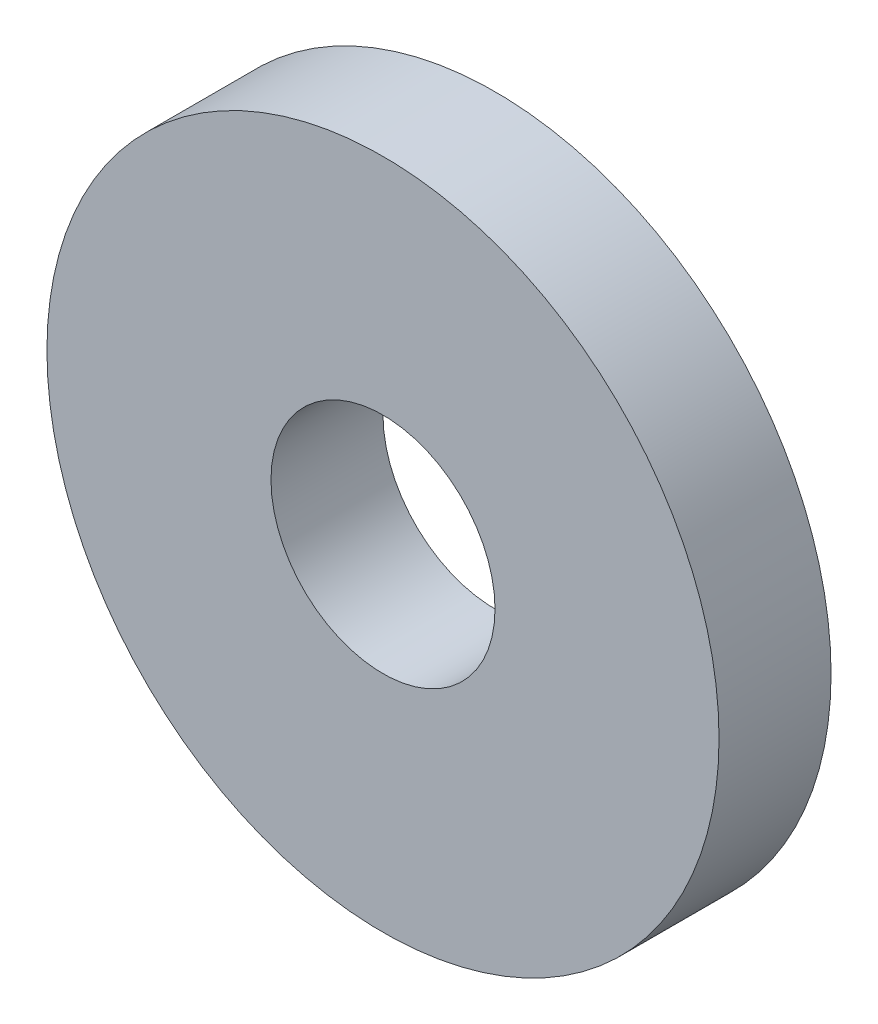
ISO-10303-21;
HEADER;
FILE_DESCRIPTION(('STEP AP214'),'2;1');
FILE_NAME('part.step','',(''),(''),'','','');
FILE_SCHEMA(('AUTOMOTIVE_DESIGN { 1 0 10303 214 1 1 1 1 }'));
ENDSEC;
DATA;
#1=APPLICATION_CONTEXT('core data for automotive mechanical design processes');
#2=APPLICATION_PROTOCOL_DEFINITION('international standard','automotive_design',2000,#1);
#3=PRODUCT_CONTEXT('',#1,'mechanical');
#4=PRODUCT('Part','Part','',(#3));
#5=PRODUCT_RELATED_PRODUCT_CATEGORY('part','',(#4));
#6=PRODUCT_DEFINITION_FORMATION('','',#4);
#7=PRODUCT_DEFINITION_CONTEXT('part definition',#1,'design');
#8=PRODUCT_DEFINITION('design','',#6,#7);
#9=PRODUCT_DEFINITION_SHAPE('','',#8);
#10=(LENGTH_UNIT() NAMED_UNIT(*) SI_UNIT(.MILLI.,.METRE.));
#11=(NAMED_UNIT(*) PLANE_ANGLE_UNIT() SI_UNIT($,.RADIAN.));
#12=(NAMED_UNIT(*) SI_UNIT($,.STERADIAN.) SOLID_ANGLE_UNIT());
#13=UNCERTAINTY_MEASURE_WITH_UNIT(LENGTH_MEASURE(1.E-05),#10,'distance_accuracy_value','');
#14=(GEOMETRIC_REPRESENTATION_CONTEXT(3) GLOBAL_UNCERTAINTY_ASSIGNED_CONTEXT((#13)) GLOBAL_UNIT_ASSIGNED_CONTEXT((#10,
#11,#12)) REPRESENTATION_CONTEXT('',''));
#15=CARTESIAN_POINT('',(0.,0.,0.));
#16=DIRECTION('',(0.,0.,1.));
#17=DIRECTION('',(1.,0.,0.));
#18=AXIS2_PLACEMENT_3D('',#15,#16,#17);
#19=CARTESIAN_POINT('',(0.,0.,1.));
#20=DIRECTION('',(0.,0.,-1.));
#21=DIRECTION('',(-1.,0.,0.));
#22=AXIS2_PLACEMENT_3D('',#19,#20,#21);
#23=CYLINDRICAL_SURFACE('',#22,3.);
#24=CARTESIAN_POINT('',(0.,0.,1.));
#25=DIRECTION('',(0.,0.,1.));
#26=DIRECTION('',(1.,0.,0.));
#27=AXIS2_PLACEMENT_3D('',#24,#25,#26);
#28=CIRCLE('',#27,3.);
#29=CARTESIAN_POINT('',(3.,0.,1.));
#30=VERTEX_POINT('',#29);
#31=EDGE_CURVE('E10',#30,#30,#28,.T.);
#32=ORIENTED_EDGE('',*,*,#31,.F.);
#33=EDGE_LOOP('',(#32));
#34=FACE_BOUND('',#33,.T.);
#35=CARTESIAN_POINT('',(0.,0.,0.));
#36=DIRECTION('',(0.,0.,1.));
#37=DIRECTION('',(1.,0.,0.));
#38=AXIS2_PLACEMENT_3D('',#35,#36,#37);
#39=CIRCLE('',#38,3.);
#40=CARTESIAN_POINT('',(3.,0.,0.));
#41=VERTEX_POINT('',#40);
#42=EDGE_CURVE('E35',#41,#41,#39,.T.);
#43=ORIENTED_EDGE('',*,*,#42,.T.);
#44=EDGE_LOOP('',(#43));
#45=FACE_BOUND('',#44,.T.);
#46=ADVANCED_FACE('F32',(#34,#45),#23,.T.);
#47=CARTESIAN_POINT('',(0.,0.,1.));
#48=DIRECTION('',(0.,0.,1.));
#49=DIRECTION('',(1.,0.,0.));
#50=AXIS2_PLACEMENT_3D('',#47,#48,#49);
#51=PLANE('',#50);
#52=CARTESIAN_POINT('',(0.,0.,1.));
#53=DIRECTION('',(0.,0.,1.));
#54=DIRECTION('',(1.,0.,0.));
#55=AXIS2_PLACEMENT_3D('',#52,#53,#54);
#56=CIRCLE('',#55,1.);
#57=CARTESIAN_POINT('',(1.,0.,1.));
#58=VERTEX_POINT('',#57);
#59=EDGE_CURVE('E44',#58,#58,#56,.T.);
#60=ORIENTED_EDGE('',*,*,#59,.F.);
#61=EDGE_LOOP('',(#60));
#62=FACE_BOUND('',#61,.T.);
#63=ORIENTED_EDGE('',*,*,#31,.T.);
#64=EDGE_LOOP('',(#63));
#65=FACE_BOUND('',#64,.T.);
#66=ADVANCED_FACE('F59',(#62,#65),#51,.T.);
#67=CARTESIAN_POINT('',(0.,0.,0.));
#68=DIRECTION('',(0.,0.,1.));
#69=DIRECTION('',(1.,0.,0.));
#70=AXIS2_PLACEMENT_3D('',#67,#68,#69);
#71=PLANE('',#70);
#72=CARTESIAN_POINT('',(0.,0.,0.));
#73=DIRECTION('',(0.,0.,1.));
#74=DIRECTION('',(1.,0.,0.));
#75=AXIS2_PLACEMENT_3D('',#72,#73,#74);
#76=CIRCLE('',#75,1.);
#77=CARTESIAN_POINT('',(1.,0.,0.));
#78=VERTEX_POINT('',#77);
#79=EDGE_CURVE('E42',#78,#78,#76,.T.);
#80=ORIENTED_EDGE('',*,*,#79,.T.);
#81=EDGE_LOOP('',(#80));
#82=FACE_BOUND('',#81,.T.);
#83=ORIENTED_EDGE('',*,*,#42,.F.);
#84=EDGE_LOOP('',(#83));
#85=FACE_BOUND('',#84,.T.);
#86=ADVANCED_FACE('F50',(#82,#85),#71,.F.);
#87=CARTESIAN_POINT('',(0.,0.,0.));
#88=DIRECTION('',(0.,0.,1.));
#89=DIRECTION('',(1.,0.,0.));
#90=AXIS2_PLACEMENT_3D('',#87,#88,#89);
#91=CYLINDRICAL_SURFACE('',#90,1.);
#92=ORIENTED_EDGE('',*,*,#79,.F.);
#93=EDGE_LOOP('',(#92));
#94=FACE_BOUND('',#93,.T.);
#95=ORIENTED_EDGE('',*,*,#59,.T.);
#96=EDGE_LOOP('',(#95));
#97=FACE_BOUND('',#96,.T.);
#98=ADVANCED_FACE('F53',(#94,#97),#91,.F.);
#99=CLOSED_SHELL('',(#46,#66,#86,#98));
#100=MANIFOLD_SOLID_BREP('B2',#99);
#101=ADVANCED_BREP_SHAPE_REPRESENTATION('',(#18,#100),#14);
#102=SHAPE_DEFINITION_REPRESENTATION(#9,#101);
ENDSEC;
END-ISO-10303-21;
